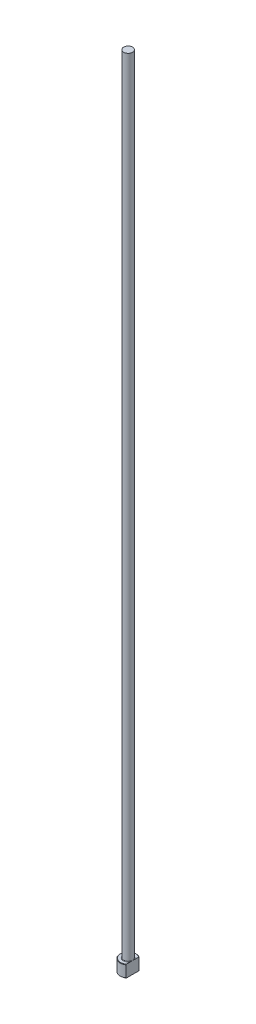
ISO-10303-21;
HEADER;
FILE_DESCRIPTION(('STEP AP214'),'2;1');
FILE_NAME('part.step','',(''),(''),'','','');
FILE_SCHEMA(('AUTOMOTIVE_DESIGN { 1 0 10303 214 1 1 1 1 }'));
ENDSEC;
DATA;
#1=APPLICATION_CONTEXT('core data for automotive mechanical design processes');
#2=APPLICATION_PROTOCOL_DEFINITION('international standard','automotive_design',2000,#1);
#3=PRODUCT_CONTEXT('',#1,'mechanical');
#4=PRODUCT('Part','Part','',(#3));
#5=PRODUCT_RELATED_PRODUCT_CATEGORY('part','',(#4));
#6=PRODUCT_DEFINITION_FORMATION('','',#4);
#7=PRODUCT_DEFINITION_CONTEXT('part definition',#1,'design');
#8=PRODUCT_DEFINITION('design','',#6,#7);
#9=PRODUCT_DEFINITION_SHAPE('','',#8);
#10=(LENGTH_UNIT() NAMED_UNIT(*) SI_UNIT(.MILLI.,.METRE.));
#11=(NAMED_UNIT(*) PLANE_ANGLE_UNIT() SI_UNIT($,.RADIAN.));
#12=(NAMED_UNIT(*) SI_UNIT($,.STERADIAN.) SOLID_ANGLE_UNIT());
#13=UNCERTAINTY_MEASURE_WITH_UNIT(LENGTH_MEASURE(1.E-05),#10,'distance_accuracy_value','');
#14=(GEOMETRIC_REPRESENTATION_CONTEXT(3) GLOBAL_UNCERTAINTY_ASSIGNED_CONTEXT((#13)) GLOBAL_UNIT_ASSIGNED_CONTEXT((#10,
#11,#12)) REPRESENTATION_CONTEXT('',''));
#15=CARTESIAN_POINT('',(0.,0.,0.));
#16=DIRECTION('',(0.,0.,1.));
#17=DIRECTION('',(1.,0.,0.));
#18=AXIS2_PLACEMENT_3D('',#15,#16,#17);
#19=CARTESIAN_POINT('',(0.,0.,0.));
#20=DIRECTION('',(0.,-1.,0.));
#21=DIRECTION('',(0.,0.,-1.));
#22=AXIS2_PLACEMENT_3D('',#19,#20,#21);
#23=PLANE('',#22);
#24=CARTESIAN_POINT('',(0.,0.,0.));
#25=DIRECTION('',(0.,-1.,0.));
#26=DIRECTION('',(0.,0.,-1.));
#27=AXIS2_PLACEMENT_3D('',#24,#25,#26);
#28=CIRCLE('',#27,3.80000000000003);
#29=CARTESIAN_POINT('',(2.24999999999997,0.,3.06227039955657));
#30=VERTEX_POINT('',#29);
#31=CARTESIAN_POINT('',(2.24999999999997,0.,-3.06227039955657));
#32=VERTEX_POINT('',#31);
#33=EDGE_CURVE('E98',#30,#32,#28,.T.);
#34=ORIENTED_EDGE('',*,*,#33,.T.);
#35=DIRECTION('',(0.,0.,1.));
#36=VECTOR('',#35,1.);
#37=CARTESIAN_POINT('',(2.24999999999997,0.,3.30718913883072));
#38=LINE('',#37,#36);
#39=EDGE_CURVE('E83',#32,#30,#38,.T.);
#40=ORIENTED_EDGE('',*,*,#39,.T.);
#41=EDGE_LOOP('',(#34,#40));
#42=FACE_BOUND('',#41,.T.);
#43=ADVANCED_FACE('F32',(#42),#23,.T.);
#44=CARTESIAN_POINT('',(0.,259.958771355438,0.));
#45=DIRECTION('',(0.,1.,0.));
#46=DIRECTION('',(0.,0.,1.));
#47=AXIS2_PLACEMENT_3D('',#44,#45,#46);
#48=CYLINDRICAL_SURFACE('',#47,3.99999999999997);
#49=CARTESIAN_POINT('',(0.,5.79999999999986,0.));
#50=DIRECTION('',(0.,1.,0.));
#51=DIRECTION('',(0.,0.,1.));
#52=AXIS2_PLACEMENT_3D('',#49,#50,#51);
#53=CIRCLE('',#52,3.99999999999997);
#54=CARTESIAN_POINT('',(2.24999999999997,5.79999999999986,3.30718913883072));
#55=VERTEX_POINT('',#54);
#56=CARTESIAN_POINT('',(2.24999999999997,5.79999999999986,-3.30718913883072));
#57=VERTEX_POINT('',#56);
#58=EDGE_CURVE('E104',#55,#57,#53,.F.);
#59=ORIENTED_EDGE('',*,*,#58,.T.);
#60=DIRECTION('',(0.,-1.,0.));
#61=VECTOR('',#60,1.);
#62=CARTESIAN_POINT('',(2.24999999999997,400.,-3.30718913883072));
#63=LINE('',#62,#61);
#64=CARTESIAN_POINT('',(2.24999999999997,0.199999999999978,-3.30718913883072));
#65=VERTEX_POINT('',#64);
#66=EDGE_CURVE('E183',#57,#65,#63,.T.);
#67=ORIENTED_EDGE('',*,*,#66,.T.);
#68=CARTESIAN_POINT('',(0.,0.199999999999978,0.));
#69=DIRECTION('',(0.,-1.,0.));
#70=DIRECTION('',(0.,0.,-1.));
#71=AXIS2_PLACEMENT_3D('',#68,#69,#70);
#72=CIRCLE('',#71,3.99999999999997);
#73=CARTESIAN_POINT('',(2.24999999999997,0.199999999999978,3.30718913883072));
#74=VERTEX_POINT('',#73);
#75=EDGE_CURVE('E100',#65,#74,#72,.F.);
#76=ORIENTED_EDGE('',*,*,#75,.T.);
#77=DIRECTION('',(0.,-1.,0.));
#78=VECTOR('',#77,1.);
#79=CARTESIAN_POINT('',(2.24999999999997,400.,3.30718913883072));
#80=LINE('',#79,#78);
#81=EDGE_CURVE('E93',#55,#74,#80,.T.);
#82=ORIENTED_EDGE('',*,*,#81,.F.);
#83=EDGE_LOOP('',(#59,#67,#76,#82));
#84=FACE_BOUND('',#83,.T.);
#85=ADVANCED_FACE('F158',(#84),#48,.T.);
#86=CARTESIAN_POINT('',(-3.99999999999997,6.,0.));
#87=DIRECTION('',(0.,1.,0.));
#88=DIRECTION('',(0.,0.,1.));
#89=AXIS2_PLACEMENT_3D('',#86,#87,#88);
#90=PLANE('',#89);
#91=CARTESIAN_POINT('',(0.,6.,0.));
#92=DIRECTION('',(0.,1.,0.));
#93=DIRECTION('',(0.,0.,1.));
#94=AXIS2_PLACEMENT_3D('',#91,#92,#93);
#95=CIRCLE('',#94,3.79999999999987);
#96=CARTESIAN_POINT('',(2.24999999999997,6.,-3.06227039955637));
#97=VERTEX_POINT('',#96);
#98=CARTESIAN_POINT('',(2.24999999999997,6.,3.06227039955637));
#99=VERTEX_POINT('',#98);
#100=EDGE_CURVE('E178',#97,#99,#95,.T.);
#101=ORIENTED_EDGE('',*,*,#100,.T.);
#102=DIRECTION('',(0.,0.,-1.));
#103=VECTOR('',#102,1.);
#104=CARTESIAN_POINT('',(2.24999999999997,6.,0.));
#105=LINE('',#104,#103);
#106=CARTESIAN_POINT('',(2.24999999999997,5.99999999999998,0.96953597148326));
#107=VERTEX_POINT('',#106);
#108=EDGE_CURVE('E57',#99,#107,#105,.T.);
#109=ORIENTED_EDGE('',*,*,#108,.T.);
#110=CARTESIAN_POINT('',(0.,6.,0.));
#111=DIRECTION('',(0.,1.,0.));
#112=DIRECTION('',(0.,0.,1.));
#113=AXIS2_PLACEMENT_3D('',#110,#111,#112);
#114=CIRCLE('',#113,2.44999999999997);
#115=CARTESIAN_POINT('',(2.24999999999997,5.99999999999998,-0.969535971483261));
#116=VERTEX_POINT('',#115);
#117=EDGE_CURVE('E107',#107,#116,#114,.F.);
#118=ORIENTED_EDGE('',*,*,#117,.T.);
#119=EDGE_CURVE('E136',#116,#97,#105,.T.);
#120=ORIENTED_EDGE('',*,*,#119,.T.);
#121=EDGE_LOOP('',(#101,#109,#118,#120));
#122=FACE_BOUND('',#121,.T.);
#123=ADVANCED_FACE('F147',(#122),#90,.T.);
#124=CARTESIAN_POINT('',(0.,6.00000000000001,0.));
#125=DIRECTION('',(0.,-1.,0.));
#126=DIRECTION('',(0.,0.,-1.));
#127=AXIS2_PLACEMENT_3D('',#124,#125,#126);
#128=CONICAL_SURFACE('',#127,3.79999999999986,0.785398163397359);
#129=ORIENTED_EDGE('',*,*,#58,.F.);
#130=CARTESIAN_POINT('',(2.24999999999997,2.18230294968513,7.27782992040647));
#131=CARTESIAN_POINT('',(2.24999999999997,2.30866715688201,7.14556140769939));
#132=CARTESIAN_POINT('',(2.24999999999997,2.43487774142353,7.01314597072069));
#133=CARTESIAN_POINT('',(2.24999999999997,2.68692885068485,6.74796170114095));
#134=CARTESIAN_POINT('',(2.24999999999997,2.81276937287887,6.61519286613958));
#135=CARTESIAN_POINT('',(2.24999999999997,3.18970572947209,6.21619905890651));
#136=CARTESIAN_POINT('',(2.24999999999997,3.44014920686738,5.94935693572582));
#137=CARTESIAN_POINT('',(2.24999999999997,3.9402606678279,5.41146981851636));
#138=CARTESIAN_POINT('',(2.24999999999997,4.18991116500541,5.14040850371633));
#139=CARTESIAN_POINT('',(2.24999999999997,4.56140055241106,4.73113683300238));
#140=CARTESIAN_POINT('',(2.24999999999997,4.68472451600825,4.59427552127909));
#141=CARTESIAN_POINT('',(2.24999999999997,4.9300940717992,4.31941326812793));
#142=CARTESIAN_POINT('',(2.24999999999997,5.0521396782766,4.18141233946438));
#143=CARTESIAN_POINT('',(2.24999999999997,5.31419582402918,3.88150807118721));
#144=CARTESIAN_POINT('',(2.24999999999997,5.45391708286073,3.71935099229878));
#145=CARTESIAN_POINT('',(2.24999999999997,5.73025215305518,3.39234412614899));
#146=CARTESIAN_POINT('',(2.24999999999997,5.86686529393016,3.22749377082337));
#147=CARTESIAN_POINT('',(2.24999999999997,6.13534139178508,2.89430849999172));
#148=CARTESIAN_POINT('',(2.24999999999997,6.26721073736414,2.72597879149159));
#149=CARTESIAN_POINT('',(2.24999999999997,6.4596678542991,2.46950762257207));
#150=CARTESIAN_POINT('',(2.24999999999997,6.52291962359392,2.38336821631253));
#151=CARTESIAN_POINT('',(2.24999999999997,6.64714184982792,2.20946418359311));
#152=CARTESIAN_POINT('',(2.24999999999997,6.70811252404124,2.12169971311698));
#153=CARTESIAN_POINT('',(2.24999999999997,6.82102230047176,1.95327886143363));
#154=CARTESIAN_POINT('',(2.24999999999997,6.87324695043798,1.87281476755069));
#155=CARTESIAN_POINT('',(2.24999999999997,6.97467249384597,1.70998172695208));
#156=CARTESIAN_POINT('',(2.24999999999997,7.02387305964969,1.62761257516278));
#157=CARTESIAN_POINT('',(2.24999999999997,7.11837607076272,1.46059799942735));
#158=CARTESIAN_POINT('',(2.24999999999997,7.16367708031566,1.37595175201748));
#159=CARTESIAN_POINT('',(2.24999999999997,7.24914050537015,1.20413766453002));
#160=CARTESIAN_POINT('',(2.24999999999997,7.28930406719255,1.11697039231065));
#161=CARTESIAN_POINT('',(2.24999999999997,7.38314726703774,0.891175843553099));
#162=CARTESIAN_POINT('',(2.24999999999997,7.43219749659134,0.750488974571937));
#163=CARTESIAN_POINT('',(2.24999999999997,7.48826674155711,0.53515963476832));
#164=CARTESIAN_POINT('',(2.24999999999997,7.50402844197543,0.462776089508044));
#165=CARTESIAN_POINT('',(2.24999999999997,7.52893388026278,0.316860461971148));
#166=CARTESIAN_POINT('',(2.24999999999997,7.53807847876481,0.24332853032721));
#167=CARTESIAN_POINT('',(2.24999999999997,7.54922474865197,0.0949504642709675));
#168=CARTESIAN_POINT('',(2.24999999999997,7.55115152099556,0.0200986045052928));
#169=CARTESIAN_POINT('',(2.24999999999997,7.54752076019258,-0.12942029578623));
#170=CARTESIAN_POINT('',(2.24999999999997,7.54196316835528,-0.204087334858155));
#171=CARTESIAN_POINT('',(2.24999999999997,7.52372329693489,-0.352688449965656));
#172=CARTESIAN_POINT('',(2.24999999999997,7.51102617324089,-0.426620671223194));
#173=CARTESIAN_POINT('',(2.24999999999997,7.4792633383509,-0.573094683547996));
#174=CARTESIAN_POINT('',(2.24999999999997,7.4601961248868,-0.645636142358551));
#175=CARTESIAN_POINT('',(2.24999999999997,7.40610994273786,-0.82370101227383));
#176=CARTESIAN_POINT('',(2.24999999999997,7.36783449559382,-0.928230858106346));
#177=CARTESIAN_POINT('',(2.24999999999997,7.2823269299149,-1.13354070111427));
#178=CARTESIAN_POINT('',(2.24999999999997,7.23508812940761,-1.23431783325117));
#179=CARTESIAN_POINT('',(2.24999999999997,7.13380125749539,-1.43298762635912));
#180=CARTESIAN_POINT('',(2.24999999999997,7.0797202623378,-1.53086330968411));
#181=CARTESIAN_POINT('',(2.24999999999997,6.99496203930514,-1.67548648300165));
#182=CARTESIAN_POINT('',(2.24999999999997,6.96610811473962,-1.72332162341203));
#183=CARTESIAN_POINT('',(2.24999999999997,6.90734436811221,-1.81833709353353));
#184=CARTESIAN_POINT('',(2.24999999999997,6.87743458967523,-1.8655174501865));
#185=CARTESIAN_POINT('',(2.24999999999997,6.77509597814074,-2.02354622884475));
#186=CARTESIAN_POINT('',(2.24999999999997,6.70057106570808,-2.13303820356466));
#187=CARTESIAN_POINT('',(2.24999999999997,6.54784662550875,-2.34943854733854));
#188=CARTESIAN_POINT('',(2.24999999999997,6.46964624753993,-2.45634630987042));
#189=CARTESIAN_POINT('',(2.24999999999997,6.31046802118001,-2.66818697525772));
#190=CARTESIAN_POINT('',(2.24999999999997,6.22948822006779,-2.77311840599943));
#191=CARTESIAN_POINT('',(2.24999999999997,6.0654522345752,-2.98134898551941));
#192=CARTESIAN_POINT('',(2.24999999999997,5.98239592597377,-3.08464803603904));
#193=CARTESIAN_POINT('',(2.24999999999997,5.73044258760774,-3.39308007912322));
#194=CARTESIAN_POINT('',(2.24999999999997,5.55914389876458,-3.59624854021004));
#195=CARTESIAN_POINT('',(2.24999999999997,5.21260420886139,-3.99901521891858));
#196=CARTESIAN_POINT('',(2.24999999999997,5.03736490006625,-4.19861490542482));
#197=CARTESIAN_POINT('',(2.24999999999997,4.68403823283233,-4.59551245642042));
#198=CARTESIAN_POINT('',(2.24999999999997,4.50594904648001,-4.79280869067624));
#199=CARTESIAN_POINT('',(2.24999999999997,4.14782580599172,-5.18566037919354));
#200=CARTESIAN_POINT('',(2.24999999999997,3.9677915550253,-5.38121565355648));
#201=CARTESIAN_POINT('',(2.24999999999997,3.60651922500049,-5.77078870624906));
#202=CARTESIAN_POINT('',(2.24999999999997,3.4252827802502,-5.96480800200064));
#203=CARTESIAN_POINT('',(2.24999999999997,3.061746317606,-6.35184762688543));
#204=CARTESIAN_POINT('',(2.24999999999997,2.87944629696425,-6.54486795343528));
#205=CARTESIAN_POINT('',(2.24999999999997,2.61112326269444,-6.82775668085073));
#206=CARTESIAN_POINT('',(2.24999999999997,2.52542128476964,-6.91792994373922));
#207=CARTESIAN_POINT('',(2.24999999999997,2.35393773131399,-7.09803491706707));
#208=CARTESIAN_POINT('',(2.24999999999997,2.26815631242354,-7.1879667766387));
#209=CARTESIAN_POINT('',(2.24999999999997,2.18230294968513,-7.27782992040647));
#210=B_SPLINE_CURVE_WITH_KNOTS('',3,(#130,#131,#132,#133,#134,#135,#136,#137,#138,#139,#140,
#141,#142,#143,#144,#145,#146,#147,#148,#149,#150,#151,#152,#153,#154,#155,#156,#157,#158,#159,
#160,#161,#162,#163,#164,#165,#166,#167,#168,#169,#170,#171,#172,#173,#174,#175,#176,#177,#178,
#179,#180,#181,#182,#183,#184,#185,#186,#187,#188,#189,#190,#191,#192,#193,#194,#195,#196,#197,
#198,#199,#200,#201,#202,#203,#204,#205,#206,#207,#208,#209),.UNSPECIFIED.,.F.,.F.,(4,2,2,2,2,2,
2,2,2,2,2,2,2,2,2,2,2,2,2,2,2,2,2,2,2,2,2,2,2,2,2,2,2,2,2,2,2,2,2,4),(0.,0.54878577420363,
1.09757528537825,2.19544562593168,3.30094607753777,3.85362276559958,4.40629327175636,
5.04841012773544,5.69066421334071,6.33201824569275,6.65259523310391,6.9731416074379,
7.26086761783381,7.54862474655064,7.83648737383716,8.1242856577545,8.56956070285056,
8.7915473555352,9.01350513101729,9.23775987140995,9.46201637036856,9.68674086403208,
9.91151839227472,10.2448678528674,10.5784668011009,10.9137368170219,11.0813178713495,
11.2488920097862,11.6461164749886,12.0434332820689,12.4410351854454,12.838660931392,
13.63579912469,14.4326012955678,15.2299368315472,16.0273538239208,16.8238479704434,
17.6203441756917,17.9935523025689,18.3664002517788),.UNSPECIFIED.);
#211=EDGE_CURVE('E135',#55,#99,#210,.T.);
#212=ORIENTED_EDGE('',*,*,#211,.T.);
#213=ORIENTED_EDGE('',*,*,#100,.F.);
#214=EDGE_CURVE('E127',#97,#57,#210,.T.);
#215=ORIENTED_EDGE('',*,*,#214,.T.);
#216=EDGE_LOOP('',(#129,#212,#213,#215));
#217=FACE_BOUND('',#216,.T.);
#218=ADVANCED_FACE('F143',(#217),#128,.T.);
#219=CARTESIAN_POINT('',(0.,0.199999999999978,0.));
#220=DIRECTION('',(0.,1.,0.));
#221=DIRECTION('',(0.,0.,1.));
#222=AXIS2_PLACEMENT_3D('',#219,#220,#221);
#223=CONICAL_SURFACE('',#222,3.99999999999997,0.785398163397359);
#224=ORIENTED_EDGE('',*,*,#75,.F.);
#225=CARTESIAN_POINT('',(2.24999999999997,3.81769705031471,-7.27782992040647));
#226=CARTESIAN_POINT('',(2.24999999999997,3.69133284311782,-7.14556140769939));
#227=CARTESIAN_POINT('',(2.24999999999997,3.5651222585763,-7.01314597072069));
#228=CARTESIAN_POINT('',(2.24999999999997,3.31307114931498,-6.74796170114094));
#229=CARTESIAN_POINT('',(2.24999999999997,3.18723062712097,-6.61519286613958));
#230=CARTESIAN_POINT('',(2.24999999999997,2.81029427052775,-6.21619905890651));
#231=CARTESIAN_POINT('',(2.24999999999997,2.55985079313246,-5.94935693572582));
#232=CARTESIAN_POINT('',(2.24999999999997,2.05973933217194,-5.41146981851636));
#233=CARTESIAN_POINT('',(2.24999999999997,1.81008883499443,-5.14040850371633));
#234=CARTESIAN_POINT('',(2.24999999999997,1.43859944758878,-4.73113683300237));
#235=CARTESIAN_POINT('',(2.24999999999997,1.31527548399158,-4.59427552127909));
#236=CARTESIAN_POINT('',(2.24999999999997,1.06990592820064,-4.31941326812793));
#237=CARTESIAN_POINT('',(2.24999999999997,0.947860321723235,-4.18141233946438));
#238=CARTESIAN_POINT('',(2.24999999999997,0.685804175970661,-3.88150807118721));
#239=CARTESIAN_POINT('',(2.24999999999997,0.54608291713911,-3.71935099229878));
#240=CARTESIAN_POINT('',(2.24999999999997,0.269747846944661,-3.39234412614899));
#241=CARTESIAN_POINT('',(2.24999999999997,0.133134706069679,-3.22749377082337));
#242=CARTESIAN_POINT('',(2.24999999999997,-0.135341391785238,-2.89430849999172));
#243=CARTESIAN_POINT('',(2.24999999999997,-0.267210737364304,-2.72597879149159));
#244=CARTESIAN_POINT('',(2.24999999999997,-0.459667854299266,-2.46950762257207));
#245=CARTESIAN_POINT('',(2.24999999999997,-0.522919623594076,-2.38336821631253));
#246=CARTESIAN_POINT('',(2.24999999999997,-0.64714184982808,-2.20946418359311));
#247=CARTESIAN_POINT('',(2.24999999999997,-0.708112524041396,-2.12169971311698));
#248=CARTESIAN_POINT('',(2.24999999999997,-0.821022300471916,-1.95327886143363));
#249=CARTESIAN_POINT('',(2.24999999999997,-0.873246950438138,-1.87281476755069));
#250=CARTESIAN_POINT('',(2.24999999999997,-0.974672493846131,-1.70998172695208));
#251=CARTESIAN_POINT('',(2.24999999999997,-1.02387305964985,-1.62761257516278));
#252=CARTESIAN_POINT('',(2.24999999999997,-1.11837607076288,-1.46059799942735));
#253=CARTESIAN_POINT('',(2.24999999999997,-1.16367708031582,-1.37595175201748));
#254=CARTESIAN_POINT('',(2.24999999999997,-1.24914050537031,-1.20413766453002));
#255=CARTESIAN_POINT('',(2.24999999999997,-1.28930406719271,-1.11697039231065));
#256=CARTESIAN_POINT('',(2.24999999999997,-1.3831472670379,-0.891175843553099));
#257=CARTESIAN_POINT('',(2.24999999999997,-1.4321974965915,-0.750488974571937));
#258=CARTESIAN_POINT('',(2.24999999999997,-1.48826674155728,-0.53515963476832));
#259=CARTESIAN_POINT('',(2.24999999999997,-1.50402844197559,-0.462776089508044));
#260=CARTESIAN_POINT('',(2.24999999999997,-1.52893388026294,-0.316860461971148));
#261=CARTESIAN_POINT('',(2.24999999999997,-1.53807847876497,-0.24332853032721));
#262=CARTESIAN_POINT('',(2.24999999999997,-1.54922474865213,-0.0949504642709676));
#263=CARTESIAN_POINT('',(2.24999999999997,-1.55115152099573,-0.0200986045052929));
#264=CARTESIAN_POINT('',(2.24999999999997,-1.54752076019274,0.12942029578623));
#265=CARTESIAN_POINT('',(2.24999999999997,-1.54196316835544,0.204087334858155));
#266=CARTESIAN_POINT('',(2.24999999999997,-1.52372329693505,0.352688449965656));
#267=CARTESIAN_POINT('',(2.24999999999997,-1.51102617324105,0.426620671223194));
#268=CARTESIAN_POINT('',(2.24999999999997,-1.47926333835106,0.573094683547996));
#269=CARTESIAN_POINT('',(2.24999999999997,-1.46019612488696,0.645636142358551));
#270=CARTESIAN_POINT('',(2.24999999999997,-1.40610994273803,0.82370101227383));
#271=CARTESIAN_POINT('',(2.24999999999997,-1.36783449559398,0.928230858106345));
#272=CARTESIAN_POINT('',(2.24999999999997,-1.28232692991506,1.13354070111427));
#273=CARTESIAN_POINT('',(2.24999999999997,-1.23508812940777,1.23431783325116));
#274=CARTESIAN_POINT('',(2.24999999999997,-1.13380125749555,1.43298762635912));
#275=CARTESIAN_POINT('',(2.24999999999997,-1.07972026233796,1.53086330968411));
#276=CARTESIAN_POINT('',(2.24999999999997,-0.994962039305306,1.67548648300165));
#277=CARTESIAN_POINT('',(2.24999999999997,-0.966108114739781,1.72332162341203));
#278=CARTESIAN_POINT('',(2.24999999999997,-0.907344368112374,1.81833709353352));
#279=CARTESIAN_POINT('',(2.24999999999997,-0.877434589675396,1.8655174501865));
#280=CARTESIAN_POINT('',(2.24999999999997,-0.775095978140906,2.02354622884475));
#281=CARTESIAN_POINT('',(2.24999999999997,-0.700571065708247,2.13303820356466));
#282=CARTESIAN_POINT('',(2.24999999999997,-0.547846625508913,2.34943854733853));
#283=CARTESIAN_POINT('',(2.24999999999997,-0.469646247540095,2.45634630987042));
#284=CARTESIAN_POINT('',(2.24999999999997,-0.310468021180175,2.66818697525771));
#285=CARTESIAN_POINT('',(2.24999999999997,-0.229488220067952,2.77311840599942));
#286=CARTESIAN_POINT('',(2.24999999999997,-0.0654522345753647,2.98134898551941));
#287=CARTESIAN_POINT('',(2.24999999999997,0.0176040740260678,3.08464803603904));
#288=CARTESIAN_POINT('',(2.24999999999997,0.269557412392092,3.39308007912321));
#289=CARTESIAN_POINT('',(2.24999999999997,0.440856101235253,3.59624854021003));
#290=CARTESIAN_POINT('',(2.24999999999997,0.787395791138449,3.99901521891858));
#291=CARTESIAN_POINT('',(2.24999999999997,0.96263509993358,4.19861490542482));
#292=CARTESIAN_POINT('',(2.24999999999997,1.31596176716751,4.59551245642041));
#293=CARTESIAN_POINT('',(2.24999999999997,1.49405095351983,4.79280869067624));
#294=CARTESIAN_POINT('',(2.24999999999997,1.85217419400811,5.18566037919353));
#295=CARTESIAN_POINT('',(2.24999999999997,2.03220844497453,5.38121565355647));
#296=CARTESIAN_POINT('',(2.24999999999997,2.39348077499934,5.77078870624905));
#297=CARTESIAN_POINT('',(2.24999999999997,2.57471721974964,5.96480800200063));
#298=CARTESIAN_POINT('',(2.24999999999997,2.93825368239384,6.35184762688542));
#299=CARTESIAN_POINT('',(2.24999999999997,3.12055370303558,6.54486795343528));
#300=CARTESIAN_POINT('',(2.24999999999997,3.38887673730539,6.82775668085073));
#301=CARTESIAN_POINT('',(2.24999999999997,3.47457871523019,6.91792994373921));
#302=CARTESIAN_POINT('',(2.24999999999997,3.64606226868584,7.09803491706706));
#303=CARTESIAN_POINT('',(2.24999999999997,3.73184368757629,7.1879667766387));
#304=CARTESIAN_POINT('',(2.24999999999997,3.81769705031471,7.27782992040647));
#305=B_SPLINE_CURVE_WITH_KNOTS('',3,(#225,#226,#227,#228,#229,#230,#231,#232,#233,#234,#235,
#236,#237,#238,#239,#240,#241,#242,#243,#244,#245,#246,#247,#248,#249,#250,#251,#252,#253,#254,
#255,#256,#257,#258,#259,#260,#261,#262,#263,#264,#265,#266,#267,#268,#269,#270,#271,#272,#273,
#274,#275,#276,#277,#278,#279,#280,#281,#282,#283,#284,#285,#286,#287,#288,#289,#290,#291,#292,
#293,#294,#295,#296,#297,#298,#299,#300,#301,#302,#303,#304),.UNSPECIFIED.,.F.,.F.,(4,2,2,2,2,2,
2,2,2,2,2,2,2,2,2,2,2,2,2,2,2,2,2,2,2,2,2,2,2,2,2,2,2,2,2,2,2,2,2,4),(0.,0.548785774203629,
1.09757528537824,2.19544562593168,3.30094607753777,3.85362276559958,4.40629327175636,
5.04841012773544,5.69066421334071,6.33201824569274,6.65259523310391,6.97314160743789,
7.26086761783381,7.54862474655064,7.83648737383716,8.12428565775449,8.56956070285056,
8.7915473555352,9.01350513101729,9.23775987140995,9.46201637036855,9.68674086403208,
9.91151839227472,10.2448678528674,10.5784668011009,10.9137368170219,11.0813178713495,
11.2488920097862,11.6461164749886,12.0434332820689,12.4410351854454,12.838660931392,
13.63579912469,14.4326012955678,15.2299368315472,16.0273538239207,16.8238479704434,
17.6203441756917,17.9935523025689,18.3664002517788),.UNSPECIFIED.);
#306=EDGE_CURVE('E86',#65,#32,#305,.T.);
#307=ORIENTED_EDGE('',*,*,#306,.T.);
#308=ORIENTED_EDGE('',*,*,#33,.F.);
#309=EDGE_CURVE('E89',#30,#74,#305,.T.);
#310=ORIENTED_EDGE('',*,*,#309,.T.);
#311=EDGE_LOOP('',(#224,#307,#308,#310));
#312=FACE_BOUND('',#311,.T.);
#313=ADVANCED_FACE('F97',(#312),#223,.T.);
#314=CARTESIAN_POINT('',(0.,6.19999999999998,0.));
#315=DIRECTION('',(0.,1.,0.));
#316=DIRECTION('',(0.,0.,1.));
#317=AXIS2_PLACEMENT_3D('',#314,#315,#316);
#318=TOROIDAL_SURFACE('',#317,2.44999999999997,0.2);
#319=CARTESIAN_POINT('',(2.24999999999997,6.19999999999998,0.));
#320=CARTESIAN_POINT('',(2.24999999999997,6.2000005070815,6.44724382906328E-11));
#321=CARTESIAN_POINT('',(2.24999999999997,6.20000101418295,-1.58891197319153E-07));
#322=CARTESIAN_POINT('',(2.24999999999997,6.20000197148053,-6.21779259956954E-07));
#323=CARTESIAN_POINT('',(2.24999999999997,6.20000241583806,-9.34460784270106E-07));
#324=CARTESIAN_POINT('',(2.24999999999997,6.20000332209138,-1.68105194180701E-06));
#325=CARTESIAN_POINT('',(2.24999999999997,6.20000377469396,-2.12646377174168E-06));
#326=CARTESIAN_POINT('',(2.24999999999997,6.20000460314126,-3.06333881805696E-06));
#327=CARTESIAN_POINT('',(2.24999999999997,6.20000498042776,-3.55360522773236E-06));
#328=CARTESIAN_POINT('',(2.24999999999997,6.20000633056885,-5.39956017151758E-06));
#329=CARTESIAN_POINT('',(2.24999999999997,6.20000722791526,-6.81237630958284E-06));
#330=CARTESIAN_POINT('',(2.24999999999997,6.20000875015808,-9.6531589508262E-06));
#331=CARTESIAN_POINT('',(2.24999999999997,6.20000938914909,-1.10739428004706E-05));
#332=CARTESIAN_POINT('',(2.24999999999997,6.20001197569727,-1.69289388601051E-05));
#333=CARTESIAN_POINT('',(2.24999999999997,6.20001384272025,-2.14029810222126E-05));
#334=CARTESIAN_POINT('',(2.24999999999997,6.20001668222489,-2.99701702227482E-05));
#335=CARTESIAN_POINT('',(2.24999999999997,6.20001774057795,-3.40349909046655E-05));
#336=CARTESIAN_POINT('',(2.24999999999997,6.20002529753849,-6.37611263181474E-05));
#337=CARTESIAN_POINT('',(2.24999999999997,6.20003087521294,-8.9609529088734E-05));
#338=CARTESIAN_POINT('',(2.24999999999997,6.20005527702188,-0.000191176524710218));
#339=CARTESIAN_POINT('',(2.24999999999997,6.20007870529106,-0.000265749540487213));
#340=CARTESIAN_POINT('',(2.24999999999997,6.2001693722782,-0.00055979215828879));
#341=CARTESIAN_POINT('',(2.24999999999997,6.20023350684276,-0.000779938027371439));
#342=CARTESIAN_POINT('',(2.24999999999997,6.20048920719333,-0.00165050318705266));
#343=CARTESIAN_POINT('',(2.24999999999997,6.20068459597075,-0.00230007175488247));
#344=CARTESIAN_POINT('',(2.24999999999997,6.20149322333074,-0.00499620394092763));
#345=CARTESIAN_POINT('',(2.24999999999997,6.2021017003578,-0.00704382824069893));
#346=CARTESIAN_POINT('',(2.24999999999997,6.20797104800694,-0.0267853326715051));
#347=CARTESIAN_POINT('',(2.24999999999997,6.21325284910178,-0.0444747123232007));
#348=CARTESIAN_POINT('',(2.24999999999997,6.22356918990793,-0.0791736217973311));
#349=CARTESIAN_POINT('',(2.24999999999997,6.22860532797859,-0.0961827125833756));
#350=CARTESIAN_POINT('',(2.24999999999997,6.23925368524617,-0.132326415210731));
#351=CARTESIAN_POINT('',(2.24999999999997,6.24485983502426,-0.151462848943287));
#352=CARTESIAN_POINT('',(2.24999999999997,6.25603662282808,-0.18996857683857));
#353=CARTESIAN_POINT('',(2.24999999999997,6.26160623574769,-0.209338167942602));
#354=CARTESIAN_POINT('',(2.24999999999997,6.27500311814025,-0.256523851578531));
#355=CARTESIAN_POINT('',(2.24999999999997,6.28276182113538,-0.284359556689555));
#356=CARTESIAN_POINT('',(2.24999999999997,6.29771346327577,-0.33942534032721));
#357=CARTESIAN_POINT('',(2.24999999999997,6.3049157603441,-0.366652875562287));
#358=CARTESIAN_POINT('',(2.24999999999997,6.32240345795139,-0.435090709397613));
#359=CARTESIAN_POINT('',(2.24999999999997,6.33239618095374,-0.476377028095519));
#360=CARTESIAN_POINT('',(2.24999999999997,6.35100390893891,-0.559624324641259));
#361=CARTESIAN_POINT('',(2.24999999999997,6.3596067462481,-0.60158805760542));
#362=CARTESIAN_POINT('',(2.24999999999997,6.37543235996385,-0.689258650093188));
#363=CARTESIAN_POINT('',(2.24999999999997,6.38248971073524,-0.734996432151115));
#364=CARTESIAN_POINT('',(2.24999999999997,6.39342529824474,-0.826730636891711));
#365=CARTESIAN_POINT('',(2.24999999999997,6.39731270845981,-0.872725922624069));
#366=CARTESIAN_POINT('',(2.24999999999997,6.40071499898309,-0.963783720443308));
#367=CARTESIAN_POINT('',(2.24999999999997,6.40033773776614,-1.00884048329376));
#368=CARTESIAN_POINT('',(2.24999999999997,6.39535803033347,-1.07577565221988));
#369=CARTESIAN_POINT('',(2.24999999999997,6.39299580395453,-1.09781842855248));
#370=CARTESIAN_POINT('',(2.24999999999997,6.38649339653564,-1.1416310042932));
#371=CARTESIAN_POINT('',(2.24999999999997,6.38235512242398,-1.16340107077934));
#372=CARTESIAN_POINT('',(2.24999999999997,6.37178290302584,-1.20664751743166));
#373=CARTESIAN_POINT('',(2.24999999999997,6.36532376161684,-1.22811787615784));
#374=CARTESIAN_POINT('',(2.24999999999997,6.34940253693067,-1.26994619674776));
#375=CARTESIAN_POINT('',(2.24999999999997,6.33994859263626,-1.29030700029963));
#376=CARTESIAN_POINT('',(2.24999999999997,6.32341167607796,-1.31784149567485));
#377=CARTESIAN_POINT('',(2.24999999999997,6.31797729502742,-1.3260012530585));
#378=CARTESIAN_POINT('',(2.24999999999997,6.30618383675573,-1.34165219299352));
#379=CARTESIAN_POINT('',(2.24999999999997,6.29982370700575,-1.34914259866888));
#380=CARTESIAN_POINT('',(2.24999999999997,6.28597385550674,-1.36322511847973));
#381=CARTESIAN_POINT('',(2.24999999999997,6.27846961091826,-1.36980324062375));
#382=CARTESIAN_POINT('',(2.24999999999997,6.26235014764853,-1.38141777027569));
#383=CARTESIAN_POINT('',(2.24999999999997,6.25373945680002,-1.38646019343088));
#384=CARTESIAN_POINT('',(2.24999999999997,6.23893119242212,-1.39291408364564));
#385=CARTESIAN_POINT('',(2.24999999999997,6.23301804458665,-1.39497873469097));
#386=CARTESIAN_POINT('',(2.24999999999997,6.22092968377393,-1.3980973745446));
#387=CARTESIAN_POINT('',(2.24999999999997,6.21475469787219,-1.39915222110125));
#388=CARTESIAN_POINT('',(2.24999999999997,6.20229305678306,-1.4001597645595));
#389=CARTESIAN_POINT('',(2.24999999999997,6.19600609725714,-1.40010876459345));
#390=CARTESIAN_POINT('',(2.24999999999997,6.18353929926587,-1.39890051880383));
#391=CARTESIAN_POINT('',(2.24999999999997,6.17735949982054,-1.39774287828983));
#392=CARTESIAN_POINT('',(2.24999999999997,6.16550896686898,-1.39448677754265));
#393=CARTESIAN_POINT('',(2.24999999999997,6.15982782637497,-1.39242539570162));
#394=CARTESIAN_POINT('',(2.24999999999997,6.14882191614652,-1.38751374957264));
#395=CARTESIAN_POINT('',(2.24999999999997,6.14349727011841,-1.38466321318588));
#396=CARTESIAN_POINT('',(2.24999999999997,6.13026923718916,-1.37647479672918));
#397=CARTESIAN_POINT('',(2.24999999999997,6.12266499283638,-1.37065399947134));
#398=CARTESIAN_POINT('',(2.24999999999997,6.10845647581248,-1.35789458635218));
#399=CARTESIAN_POINT('',(2.24999999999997,6.10185542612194,-1.3509525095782));
#400=CARTESIAN_POINT('',(2.24999999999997,6.0855320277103,-1.33150080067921));
#401=CARTESIAN_POINT('',(2.24999999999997,6.07660573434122,-1.31832816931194));
#402=CARTESIAN_POINT('',(2.24999999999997,6.06078136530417,-1.29086374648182));
#403=CARTESIAN_POINT('',(2.24999999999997,6.05388481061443,-1.27657112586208));
#404=CARTESIAN_POINT('',(2.24999999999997,6.03602738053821,-1.23377116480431));
#405=CARTESIAN_POINT('',(2.24999999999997,6.02722778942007,-1.20437236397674));
#406=CARTESIAN_POINT('',(2.24999999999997,6.01362163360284,-1.14441037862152));
#407=CARTESIAN_POINT('',(2.24999999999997,6.00886464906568,-1.11383741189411));
#408=CARTESIAN_POINT('',(2.24999999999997,6.00105881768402,-1.03966563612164));
#409=CARTESIAN_POINT('',(2.24999999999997,5.99953171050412,-0.995912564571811));
#410=CARTESIAN_POINT('',(2.24999999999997,6.00070174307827,-0.9083672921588));
#411=CARTESIAN_POINT('',(2.24999999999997,6.00341475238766,-0.864575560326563));
#412=CARTESIAN_POINT('',(2.24999999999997,6.01171554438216,-0.779778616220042));
#413=CARTESIAN_POINT('',(2.24999999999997,6.01713219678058,-0.73875579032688));
#414=CARTESIAN_POINT('',(2.24999999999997,6.0300163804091,-0.657360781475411));
#415=CARTESIAN_POINT('',(2.24999999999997,6.03746816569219,-0.616986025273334));
#416=CARTESIAN_POINT('',(2.24999999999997,6.0540572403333,-0.53598173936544));
#417=CARTESIAN_POINT('',(2.24999999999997,6.0632173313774,-0.495356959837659));
#418=CARTESIAN_POINT('',(2.24999999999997,6.08297396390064,-0.413374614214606));
#419=CARTESIAN_POINT('',(2.24999999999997,6.09360096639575,-0.372024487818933));
#420=CARTESIAN_POINT('',(2.24999999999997,6.11230155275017,-0.302306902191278));
#421=CARTESIAN_POINT('',(2.24999999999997,6.12014883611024,-0.273877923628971));
#422=CARTESIAN_POINT('',(2.24999999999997,6.1360590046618,-0.217411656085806));
#423=CARTESIAN_POINT('',(2.24999999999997,6.14411864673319,-0.189373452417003));
#424=CARTESIAN_POINT('',(2.24999999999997,6.15951571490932,-0.136466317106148));
#425=CARTESIAN_POINT('',(2.24999999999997,6.16683378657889,-0.111591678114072));
#426=CARTESIAN_POINT('',(2.24999999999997,6.18187191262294,-0.0608432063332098));
#427=CARTESIAN_POINT('',(2.24999999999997,6.18959608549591,-0.0349705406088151));
#428=CARTESIAN_POINT('',(2.24999999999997,6.19789887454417,-0.00704171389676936));
#429=CARTESIAN_POINT('',(2.24999999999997,6.19850801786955,-0.00499199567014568));
#430=CARTESIAN_POINT('',(2.24999999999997,6.19931680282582,-0.00229537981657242));
#431=CARTESIAN_POINT('',(2.24999999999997,6.19951170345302,-0.00164742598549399));
#432=CARTESIAN_POINT('',(2.24999999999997,6.19976680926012,-0.000778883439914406));
#433=CARTESIAN_POINT('',(2.24999999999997,6.19983082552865,-0.000559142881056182));
#434=CARTESIAN_POINT('',(2.24999999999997,6.19992134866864,-0.000265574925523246));
#435=CARTESIAN_POINT('',(2.24999999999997,6.19994475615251,-0.000191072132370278));
#436=CARTESIAN_POINT('',(2.24999999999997,6.1999691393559,-8.95867312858E-05));
#437=CARTESIAN_POINT('',(2.24999999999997,6.19997471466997,-6.37485909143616E-05));
#438=CARTESIAN_POINT('',(2.24999999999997,6.19998226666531,-3.40328344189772E-05));
#439=CARTESIAN_POINT('',(2.24999999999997,6.19998332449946,-2.99686231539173E-05));
#440=CARTESIAN_POINT('',(2.24999999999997,6.19998616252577,-2.1402647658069E-05));
#441=CARTESIAN_POINT('',(2.24999999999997,6.19998802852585,-1.69291780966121E-05));
#442=CARTESIAN_POINT('',(2.24999999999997,6.19999061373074,-1.10747628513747E-05));
#443=CARTESIAN_POINT('',(2.24999999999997,6.19999125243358,-9.65402457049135E-06));
#444=CARTESIAN_POINT('',(2.24999999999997,6.19999277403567,-6.81328226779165E-06));
#445=CARTESIAN_POINT('',(2.24999999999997,6.19999367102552,-5.40045593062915E-06));
#446=CARTESIAN_POINT('',(2.24999999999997,6.19999502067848,-3.55442707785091E-06));
#447=CARTESIAN_POINT('',(2.24999999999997,6.19999539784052,-3.06412589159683E-06));
#448=CARTESIAN_POINT('',(2.24999999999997,6.19999622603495,-2.12715884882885E-06));
#449=CARTESIAN_POINT('',(2.24999999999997,6.19999667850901,-1.68168921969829E-06));
#450=CARTESIAN_POINT('',(2.24999999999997,6.19999758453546,-9.3496060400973E-07));
#451=CARTESIAN_POINT('',(2.24999999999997,6.19999802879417,-6.22203859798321E-07));
#452=CARTESIAN_POINT('',(2.24999999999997,6.1999989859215,-1.59128814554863E-07));
#453=CARTESIAN_POINT('',(2.24999999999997,6.19999949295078,-6.44683302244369E-11));
#454=CARTESIAN_POINT('',(2.24999999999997,6.19999999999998,0.));
#455=B_SPLINE_CURVE_WITH_KNOTS('',3,(#319,#320,#321,#322,#323,#324,#325,#326,#327,#328,#329,
#330,#331,#332,#333,#334,#335,#336,#337,#338,#339,#340,#341,#342,#343,#344,#345,#346,#347,#348,
#349,#350,#351,#352,#353,#354,#355,#356,#357,#358,#359,#360,#361,#362,#363,#364,#365,#366,#367,
#368,#369,#370,#371,#372,#373,#374,#375,#376,#377,#378,#379,#380,#381,#382,#383,#384,#385,#386,
#387,#388,#389,#390,#391,#392,#393,#394,#395,#396,#397,#398,#399,#400,#401,#402,#403,#404,#405,
#406,#407,#408,#409,#410,#411,#412,#413,#414,#415,#416,#417,#418,#419,#420,#421,#422,#423,#424,
#425,#426,#427,#428,#429,#430,#431,#432,#433,#434,#435,#436,#437,#438,#439,#440,#441,#442,#443,
#444,#445,#446,#447,#448,#449,#450,#451,#452,#453,#454),.UNSPECIFIED.,.T.,.F.,(4,2,2,2,2,2,2,2,
2,2,2,2,2,2,2,2,2,2,2,2,2,2,2,2,2,2,2,2,2,2,2,2,2,2,2,2,2,2,2,2,2,2,2,2,2,2,2,2,2,2,2,2,2,2,2,2,
2,2,2,2,2,2,2,2,2,2,2,4),(0.,1.52660877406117E-06,3.15241312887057E-06,5.04759814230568E-06,
6.90201312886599E-06,1.19024879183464E-05,1.65722252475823E-05,3.10841856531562E-05,
4.36688546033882E-05,0.000123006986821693,0.000357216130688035,0.00104540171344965,
0.00308000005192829,0.00948876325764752,0.0648698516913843,0.118087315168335,0.17790910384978,
0.238372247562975,0.325060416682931,0.409550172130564,0.536965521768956,0.665442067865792,
0.804194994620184,0.942544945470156,1.07740386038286,1.14385780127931,1.21024056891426,
1.2773669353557,1.34431241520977,1.37367425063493,1.40306973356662,1.43287536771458,
1.46256269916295,1.48127715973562,1.49997570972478,1.51873677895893,1.53750454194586,
1.55556541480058,1.57363252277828,1.60219661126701,1.63085061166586,1.67831692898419,
1.72581872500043,1.81736829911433,1.91002510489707,2.04102939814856,2.17252517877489,
2.29658958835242,2.41972004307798,2.54462990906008,2.67269769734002,2.76117244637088,
2.84869182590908,2.9264787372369,3.00747864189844,3.01389398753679,3.01592352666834,
3.01661044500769,3.01684443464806,3.01692374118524,3.0169363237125,3.01695083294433,
3.01695550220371,3.01696050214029,3.01696235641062,3.01696425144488,3.01696587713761,
3.01696740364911),.UNSPECIFIED.);
#456=CARTESIAN_POINT('',(2.24999999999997,6.19999999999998,0.));
#457=VERTEX_POINT('',#456);
#458=EDGE_CURVE('E11',#116,#457,#455,.T.);
#459=ORIENTED_EDGE('',*,*,#458,.F.);
#460=ORIENTED_EDGE('',*,*,#117,.F.);
#461=CARTESIAN_POINT('',(2.24999999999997,6.19999999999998,0.));
#462=CARTESIAN_POINT('',(2.24999999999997,6.19999949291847,-6.4472444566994E-11));
#463=CARTESIAN_POINT('',(2.24999999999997,6.19999898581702,1.58891197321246E-07));
#464=CARTESIAN_POINT('',(2.24999999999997,6.19999802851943,6.2177925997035E-07));
#465=CARTESIAN_POINT('',(2.24999999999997,6.1999975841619,9.3446078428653E-07));
#466=CARTESIAN_POINT('',(2.24999999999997,6.19999667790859,1.68105194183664E-06));
#467=CARTESIAN_POINT('',(2.24999999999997,6.199996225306,2.1264637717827E-06));
#468=CARTESIAN_POINT('',(2.24999999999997,6.19999539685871,3.06333881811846E-06));
#469=CARTESIAN_POINT('',(2.24999999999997,6.1999950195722,3.55360522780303E-06));
#470=CARTESIAN_POINT('',(2.24999999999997,6.19999366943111,5.39956017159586E-06));
#471=CARTESIAN_POINT('',(2.24999999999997,6.19999277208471,6.81237630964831E-06));
#472=CARTESIAN_POINT('',(2.24999999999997,6.19999124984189,9.65315895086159E-06));
#473=CARTESIAN_POINT('',(2.24999999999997,6.19999061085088,1.10739428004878E-05));
#474=CARTESIAN_POINT('',(2.24999999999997,6.19998802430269,1.69289388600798E-05));
#475=CARTESIAN_POINT('',(2.24999999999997,6.19998615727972,2.14029810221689E-05));
#476=CARTESIAN_POINT('',(2.24999999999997,6.19998331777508,2.99701702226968E-05));
#477=CARTESIAN_POINT('',(2.24999999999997,6.19998225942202,3.40349909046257E-05));
#478=CARTESIAN_POINT('',(2.24999999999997,6.19997470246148,6.37611263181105E-05));
#479=CARTESIAN_POINT('',(2.24999999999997,6.19996912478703,8.9609529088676E-05));
#480=CARTESIAN_POINT('',(2.24999999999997,6.19994472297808,0.000191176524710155));
#481=CARTESIAN_POINT('',(2.24999999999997,6.1999212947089,0.000265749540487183));
#482=CARTESIAN_POINT('',(2.24999999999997,6.19983062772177,0.000559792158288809));
#483=CARTESIAN_POINT('',(2.24999999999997,6.1997664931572,0.000779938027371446));
#484=CARTESIAN_POINT('',(2.24999999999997,6.19951079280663,0.00165050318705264));
#485=CARTESIAN_POINT('',(2.24999999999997,6.19931540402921,0.00230007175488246));
#486=CARTESIAN_POINT('',(2.24999999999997,6.19850677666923,0.00499620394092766));
#487=CARTESIAN_POINT('',(2.24999999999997,6.19789829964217,0.00704382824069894));
#488=CARTESIAN_POINT('',(2.24999999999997,6.19202895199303,0.0267853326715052));
#489=CARTESIAN_POINT('',(2.24999999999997,6.18674715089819,0.0444747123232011));
#490=CARTESIAN_POINT('',(2.24999999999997,6.17643081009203,0.0791736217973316));
#491=CARTESIAN_POINT('',(2.24999999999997,6.17139467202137,0.0961827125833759));
#492=CARTESIAN_POINT('',(2.24999999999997,6.1607463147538,0.132326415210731));
#493=CARTESIAN_POINT('',(2.24999999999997,6.15514016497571,0.151462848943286));
#494=CARTESIAN_POINT('',(2.24999999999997,6.14396337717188,0.18996857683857));
#495=CARTESIAN_POINT('',(2.24999999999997,6.13839376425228,0.209338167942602));
#496=CARTESIAN_POINT('',(2.24999999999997,6.12499688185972,0.256523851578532));
#497=CARTESIAN_POINT('',(2.24999999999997,6.11723817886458,0.284359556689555));
#498=CARTESIAN_POINT('',(2.24999999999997,6.10228653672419,0.33942534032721));
#499=CARTESIAN_POINT('',(2.24999999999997,6.09508423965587,0.366652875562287));
#500=CARTESIAN_POINT('',(2.24999999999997,6.07759654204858,0.435090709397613));
#501=CARTESIAN_POINT('',(2.24999999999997,6.06760381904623,0.476377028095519));
#502=CARTESIAN_POINT('',(2.24999999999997,6.04899609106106,0.559624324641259));
#503=CARTESIAN_POINT('',(2.24999999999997,6.04039325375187,0.60158805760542));
#504=CARTESIAN_POINT('',(2.24999999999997,6.02456764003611,0.689258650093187));
#505=CARTESIAN_POINT('',(2.24999999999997,6.01751028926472,0.734996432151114));
#506=CARTESIAN_POINT('',(2.24999999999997,6.00657470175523,0.826730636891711));
#507=CARTESIAN_POINT('',(2.24999999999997,6.00268729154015,0.872725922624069));
#508=CARTESIAN_POINT('',(2.24999999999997,5.99928500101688,0.963783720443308));
#509=CARTESIAN_POINT('',(2.24999999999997,5.99966226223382,1.00884048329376));
#510=CARTESIAN_POINT('',(2.24999999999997,6.0046419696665,1.07577565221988));
#511=CARTESIAN_POINT('',(2.24999999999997,6.00700419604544,1.09781842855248));
#512=CARTESIAN_POINT('',(2.24999999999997,6.01350660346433,1.1416310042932));
#513=CARTESIAN_POINT('',(2.24999999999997,6.01764487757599,1.16340107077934));
#514=CARTESIAN_POINT('',(2.24999999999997,6.02821709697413,1.20664751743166));
#515=CARTESIAN_POINT('',(2.24999999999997,6.03467623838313,1.22811787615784));
#516=CARTESIAN_POINT('',(2.24999999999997,6.0505974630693,1.26994619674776));
#517=CARTESIAN_POINT('',(2.24999999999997,6.0600514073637,1.29030700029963));
#518=CARTESIAN_POINT('',(2.24999999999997,6.07658832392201,1.31784149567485));
#519=CARTESIAN_POINT('',(2.24999999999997,6.08202270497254,1.3260012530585));
#520=CARTESIAN_POINT('',(2.24999999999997,6.09381616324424,1.34165219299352));
#521=CARTESIAN_POINT('',(2.24999999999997,6.10017629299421,1.34914259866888));
#522=CARTESIAN_POINT('',(2.24999999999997,6.11402614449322,1.36322511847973));
#523=CARTESIAN_POINT('',(2.24999999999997,6.12153038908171,1.36980324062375));
#524=CARTESIAN_POINT('',(2.24999999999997,6.13764985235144,1.38141777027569));
#525=CARTESIAN_POINT('',(2.24999999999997,6.14626054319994,1.38646019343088));
#526=CARTESIAN_POINT('',(2.24999999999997,6.16106880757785,1.39291408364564));
#527=CARTESIAN_POINT('',(2.24999999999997,6.16698195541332,1.39497873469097));
#528=CARTESIAN_POINT('',(2.24999999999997,6.17907031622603,1.3980973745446));
#529=CARTESIAN_POINT('',(2.24999999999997,6.18524530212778,1.39915222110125));
#530=CARTESIAN_POINT('',(2.24999999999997,6.1977069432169,1.4001597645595));
#531=CARTESIAN_POINT('',(2.24999999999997,6.20399390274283,1.40010876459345));
#532=CARTESIAN_POINT('',(2.24999999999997,6.21646070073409,1.39890051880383));
#533=CARTESIAN_POINT('',(2.24999999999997,6.22264050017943,1.39774287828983));
#534=CARTESIAN_POINT('',(2.24999999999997,6.23449103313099,1.39448677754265));
#535=CARTESIAN_POINT('',(2.24999999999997,6.240172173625,1.39242539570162));
#536=CARTESIAN_POINT('',(2.24999999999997,6.25117808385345,1.38751374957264));
#537=CARTESIAN_POINT('',(2.24999999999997,6.25650272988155,1.38466321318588));
#538=CARTESIAN_POINT('',(2.24999999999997,6.26973076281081,1.37647479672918));
#539=CARTESIAN_POINT('',(2.24999999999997,6.27733500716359,1.37065399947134));
#540=CARTESIAN_POINT('',(2.24999999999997,6.29154352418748,1.35789458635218));
#541=CARTESIAN_POINT('',(2.24999999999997,6.29814457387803,1.3509525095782));
#542=CARTESIAN_POINT('',(2.24999999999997,6.31446797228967,1.33150080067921));
#543=CARTESIAN_POINT('',(2.24999999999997,6.32339426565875,1.31832816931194));
#544=CARTESIAN_POINT('',(2.24999999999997,6.3392186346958,1.29086374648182));
#545=CARTESIAN_POINT('',(2.24999999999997,6.34611518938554,1.27657112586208));
#546=CARTESIAN_POINT('',(2.24999999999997,6.36397261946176,1.23377116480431));
#547=CARTESIAN_POINT('',(2.24999999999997,6.3727722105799,1.20437236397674));
#548=CARTESIAN_POINT('',(2.24999999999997,6.38637836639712,1.14441037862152));
#549=CARTESIAN_POINT('',(2.24999999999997,6.39113535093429,1.11383741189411));
#550=CARTESIAN_POINT('',(2.24999999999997,6.39894118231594,1.03966563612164));
#551=CARTESIAN_POINT('',(2.24999999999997,6.40046828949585,0.995912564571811));
#552=CARTESIAN_POINT('',(2.24999999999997,6.3992982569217,0.9083672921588));
#553=CARTESIAN_POINT('',(2.24999999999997,6.39658524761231,0.864575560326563));
#554=CARTESIAN_POINT('',(2.24999999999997,6.38828445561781,0.779778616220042));
#555=CARTESIAN_POINT('',(2.24999999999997,6.38286780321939,0.73875579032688));
#556=CARTESIAN_POINT('',(2.24999999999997,6.36998361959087,0.657360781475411));
#557=CARTESIAN_POINT('',(2.24999999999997,6.36253183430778,0.616986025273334));
#558=CARTESIAN_POINT('',(2.24999999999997,6.34594275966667,0.53598173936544));
#559=CARTESIAN_POINT('',(2.24999999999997,6.33678266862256,0.495356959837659));
#560=CARTESIAN_POINT('',(2.24999999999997,6.31702603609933,0.413374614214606));
#561=CARTESIAN_POINT('',(2.24999999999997,6.30639903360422,0.372024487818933));
#562=CARTESIAN_POINT('',(2.24999999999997,6.2876984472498,0.302306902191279));
#563=CARTESIAN_POINT('',(2.24999999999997,6.27985116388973,0.273877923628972));
#564=CARTESIAN_POINT('',(2.24999999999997,6.26394099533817,0.217411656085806));
#565=CARTESIAN_POINT('',(2.24999999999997,6.25588135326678,0.189373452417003));
#566=CARTESIAN_POINT('',(2.24999999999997,6.24048428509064,0.136466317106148));
#567=CARTESIAN_POINT('',(2.24999999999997,6.23316621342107,0.111591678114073));
#568=CARTESIAN_POINT('',(2.24999999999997,6.21812808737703,0.0608432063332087));
#569=CARTESIAN_POINT('',(2.24999999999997,6.21040391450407,0.0349705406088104));
#570=CARTESIAN_POINT('',(2.24999999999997,6.2021011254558,0.00704171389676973));
#571=CARTESIAN_POINT('',(2.24999999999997,6.20149198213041,0.00499199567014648));
#572=CARTESIAN_POINT('',(2.24999999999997,6.20068319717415,0.00229537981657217));
#573=CARTESIAN_POINT('',(2.24999999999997,6.20048829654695,0.00164742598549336));
#574=CARTESIAN_POINT('',(2.24999999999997,6.20023319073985,0.000778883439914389));
#575=CARTESIAN_POINT('',(2.24999999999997,6.20016917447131,0.000559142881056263));
#576=CARTESIAN_POINT('',(2.24999999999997,6.20007865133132,0.000265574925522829));
#577=CARTESIAN_POINT('',(2.24999999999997,6.20005524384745,0.000191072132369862));
#578=CARTESIAN_POINT('',(2.24999999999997,6.20003086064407,8.95867312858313E-05));
#579=CARTESIAN_POINT('',(2.24999999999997,6.20002528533,6.37485909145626E-05));
#580=CARTESIAN_POINT('',(2.24999999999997,6.20001773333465,3.40328344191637E-05));
#581=CARTESIAN_POINT('',(2.24999999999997,6.20001667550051,2.99686231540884E-05));
#582=CARTESIAN_POINT('',(2.24999999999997,6.2000138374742,2.14026476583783E-05));
#583=CARTESIAN_POINT('',(2.24999999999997,6.20001197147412,1.6929178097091E-05));
#584=CARTESIAN_POINT('',(2.24999999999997,6.20000938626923,1.10747628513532E-05));
#585=CARTESIAN_POINT('',(2.24999999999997,6.20000874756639,9.65402457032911E-06));
#586=CARTESIAN_POINT('',(2.24999999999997,6.2000072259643,6.8132822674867E-06));
#587=CARTESIAN_POINT('',(2.24999999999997,6.20000632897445,5.40045593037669E-06));
#588=CARTESIAN_POINT('',(2.24999999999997,6.20000497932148,3.55442707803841E-06));
#589=CARTESIAN_POINT('',(2.24999999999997,6.20000460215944,3.06412589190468E-06));
#590=CARTESIAN_POINT('',(2.24999999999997,6.20000377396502,2.12715884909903E-06));
#591=CARTESIAN_POINT('',(2.24999999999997,6.20000332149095,1.68168921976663E-06));
#592=CARTESIAN_POINT('',(2.24999999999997,6.2000024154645,9.34960603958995E-07));
#593=CARTESIAN_POINT('',(2.24999999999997,6.2000019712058,6.2220385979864E-07));
#594=CARTESIAN_POINT('',(2.24999999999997,6.20000101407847,1.59128814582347E-07));
#595=CARTESIAN_POINT('',(2.24999999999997,6.20000050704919,6.44683365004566E-11));
#596=CARTESIAN_POINT('',(2.24999999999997,6.19999999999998,0.));
#597=B_SPLINE_CURVE_WITH_KNOTS('',3,(#461,#462,#463,#464,#465,#466,#467,#468,#469,#470,#471,
#472,#473,#474,#475,#476,#477,#478,#479,#480,#481,#482,#483,#484,#485,#486,#487,#488,#489,#490,
#491,#492,#493,#494,#495,#496,#497,#498,#499,#500,#501,#502,#503,#504,#505,#506,#507,#508,#509,
#510,#511,#512,#513,#514,#515,#516,#517,#518,#519,#520,#521,#522,#523,#524,#525,#526,#527,#528,
#529,#530,#531,#532,#533,#534,#535,#536,#537,#538,#539,#540,#541,#542,#543,#544,#545,#546,#547,
#548,#549,#550,#551,#552,#553,#554,#555,#556,#557,#558,#559,#560,#561,#562,#563,#564,#565,#566,
#567,#568,#569,#570,#571,#572,#573,#574,#575,#576,#577,#578,#579,#580,#581,#582,#583,#584,#585,
#586,#587,#588,#589,#590,#591,#592,#593,#594,#595,#596),.UNSPECIFIED.,.T.,.F.,(4,2,2,2,2,2,2,2,
2,2,2,2,2,2,2,2,2,2,2,2,2,2,2,2,2,2,2,2,2,2,2,2,2,2,2,2,2,2,2,2,2,2,2,2,2,2,2,2,2,2,2,2,2,2,2,2,
2,2,2,2,2,2,2,2,2,2,2,4),(0.,1.52660877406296E-06,3.1524131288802E-06,5.04759814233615E-06,
6.90201312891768E-06,1.1902487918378E-05,1.65722252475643E-05,3.10841856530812E-05,
4.36688546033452E-05,0.000123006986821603,0.000357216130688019,0.00104540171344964,
0.00308000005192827,0.0094887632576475,0.0648698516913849,0.118087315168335,0.17790910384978,
0.238372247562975,0.325060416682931,0.409550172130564,0.536965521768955,0.665442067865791,
0.804194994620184,0.942544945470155,1.07740386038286,1.14385780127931,1.21024056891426,
1.2773669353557,1.34431241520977,1.37367425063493,1.40306973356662,1.43287536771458,
1.46256269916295,1.48127715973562,1.49997570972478,1.51873677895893,1.53750454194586,
1.55556541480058,1.57363252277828,1.60219661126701,1.63085061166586,1.67831692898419,
1.72581872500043,1.81736829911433,1.91002510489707,2.04102939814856,2.17252517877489,
2.29658958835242,2.41972004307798,2.54462990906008,2.67269769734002,2.76117244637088,
2.84869182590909,2.9264787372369,3.00747864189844,3.01389398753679,3.01592352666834,
3.0166104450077,3.01684443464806,3.01692374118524,3.0169363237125,3.01695083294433,
3.01695550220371,3.01696050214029,3.01696235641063,3.01696425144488,3.01696587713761,
3.01696740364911),.UNSPECIFIED.);
#598=EDGE_CURVE('E46',#457,#107,#597,.T.);
#599=ORIENTED_EDGE('',*,*,#598,.F.);
#600=CARTESIAN_POINT('',(0.,6.19999999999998,0.));
#601=DIRECTION('',(0.,1.,0.));
#602=DIRECTION('',(0.,0.,1.));
#603=AXIS2_PLACEMENT_3D('',#600,#601,#602);
#604=CIRCLE('',#603,2.24999999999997);
#605=EDGE_CURVE('E103',#457,#457,#604,.T.);
#606=ORIENTED_EDGE('',*,*,#605,.F.);
#607=EDGE_LOOP('',(#459,#460,#599,#606));
#608=FACE_BOUND('',#607,.T.);
#609=ADVANCED_FACE('F34',(#608),#318,.F.);
#610=CARTESIAN_POINT('',(0.,259.958771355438,0.));
#611=DIRECTION('',(0.,1.,0.));
#612=DIRECTION('',(0.,0.,1.));
#613=AXIS2_PLACEMENT_3D('',#610,#611,#612);
#614=CYLINDRICAL_SURFACE('',#613,2.24999999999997);
#615=ORIENTED_EDGE('',*,*,#605,.T.);
#616=EDGE_LOOP('',(#615));
#617=FACE_BOUND('',#616,.T.);
#618=CARTESIAN_POINT('',(0.,400.,0.));
#619=DIRECTION('',(0.,1.,0.));
#620=DIRECTION('',(0.,0.,1.));
#621=AXIS2_PLACEMENT_3D('',#618,#619,#620);
#622=CIRCLE('',#621,2.24999999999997);
#623=CARTESIAN_POINT('',(0.,400.,2.24999999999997));
#624=VERTEX_POINT('',#623);
#625=EDGE_CURVE('E101',#624,#624,#622,.T.);
#626=ORIENTED_EDGE('',*,*,#625,.F.);
#627=EDGE_LOOP('',(#626));
#628=FACE_BOUND('',#627,.T.);
#629=ADVANCED_FACE('F155',(#617,#628),#614,.T.);
#630=CARTESIAN_POINT('',(-2.24999999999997,400.,0.));
#631=DIRECTION('',(0.,1.,0.));
#632=DIRECTION('',(0.,0.,1.));
#633=AXIS2_PLACEMENT_3D('',#630,#631,#632);
#634=PLANE('',#633);
#635=ORIENTED_EDGE('',*,*,#625,.T.);
#636=EDGE_LOOP('',(#635));
#637=FACE_BOUND('',#636,.T.);
#638=ADVANCED_FACE('F121',(#637),#634,.T.);
#639=CARTESIAN_POINT('',(2.24999999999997,400.,3.30718913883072));
#640=DIRECTION('',(1.,0.,0.));
#641=DIRECTION('',(0.,0.,-1.));
#642=AXIS2_PLACEMENT_3D('',#639,#640,#641);
#643=PLANE('',#642);
#644=ORIENTED_EDGE('',*,*,#66,.F.);
#645=ORIENTED_EDGE('',*,*,#214,.F.);
#646=ORIENTED_EDGE('',*,*,#119,.F.);
#647=ORIENTED_EDGE('',*,*,#458,.T.);
#648=ORIENTED_EDGE('',*,*,#598,.T.);
#649=ORIENTED_EDGE('',*,*,#108,.F.);
#650=ORIENTED_EDGE('',*,*,#211,.F.);
#651=ORIENTED_EDGE('',*,*,#81,.T.);
#652=ORIENTED_EDGE('',*,*,#309,.F.);
#653=ORIENTED_EDGE('',*,*,#39,.F.);
#654=ORIENTED_EDGE('',*,*,#306,.F.);
#655=EDGE_LOOP('',(#644,#645,#646,#647,#648,#649,#650,#651,#652,#653,#654));
#656=FACE_BOUND('',#655,.T.);
#657=ADVANCED_FACE('F85',(#656),#643,.T.);
#658=CLOSED_SHELL('',(#43,#85,#123,#218,#313,#609,#629,#638,#657));
#659=MANIFOLD_SOLID_BREP('B2',#658);
#660=ADVANCED_BREP_SHAPE_REPRESENTATION('',(#18,#659),#14);
#661=SHAPE_DEFINITION_REPRESENTATION(#9,#660);
ENDSEC;
END-ISO-10303-21;
